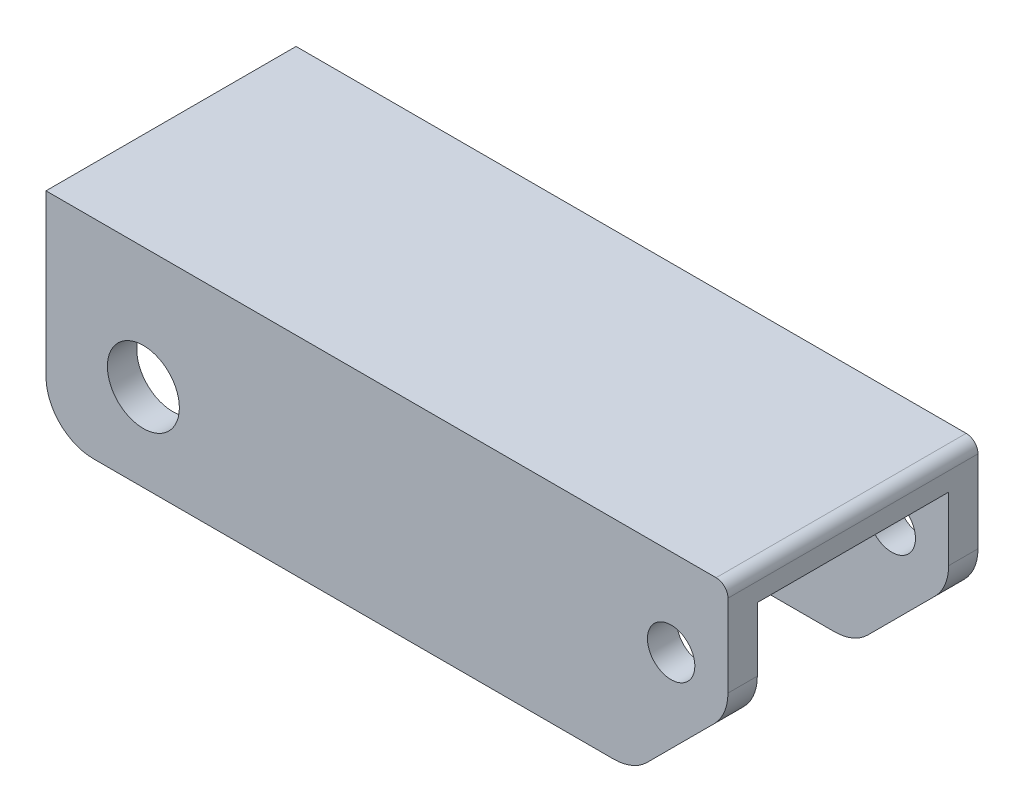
ISO-10303-21;
HEADER;
FILE_DESCRIPTION(('STEP AP214'),'2;1');
FILE_NAME('part.step','',(''),(''),'','','');
FILE_SCHEMA(('AUTOMOTIVE_DESIGN { 1 0 10303 214 1 1 1 1 }'));
ENDSEC;
DATA;
#1=APPLICATION_CONTEXT('core data for automotive mechanical design processes');
#2=APPLICATION_PROTOCOL_DEFINITION('international standard','automotive_design',2000,#1);
#3=PRODUCT_CONTEXT('',#1,'mechanical');
#4=PRODUCT('Part','Part','',(#3));
#5=PRODUCT_RELATED_PRODUCT_CATEGORY('part','',(#4));
#6=PRODUCT_DEFINITION_FORMATION('','',#4);
#7=PRODUCT_DEFINITION_CONTEXT('part definition',#1,'design');
#8=PRODUCT_DEFINITION('design','',#6,#7);
#9=PRODUCT_DEFINITION_SHAPE('','',#8);
#10=(LENGTH_UNIT() NAMED_UNIT(*) SI_UNIT(.MILLI.,.METRE.));
#11=(NAMED_UNIT(*) PLANE_ANGLE_UNIT() SI_UNIT($,.RADIAN.));
#12=(NAMED_UNIT(*) SI_UNIT($,.STERADIAN.) SOLID_ANGLE_UNIT());
#13=UNCERTAINTY_MEASURE_WITH_UNIT(LENGTH_MEASURE(1.E-05),#10,'distance_accuracy_value','');
#14=(GEOMETRIC_REPRESENTATION_CONTEXT(3) GLOBAL_UNCERTAINTY_ASSIGNED_CONTEXT((#13)) GLOBAL_UNIT_ASSIGNED_CONTEXT((#10,
#11,#12)) REPRESENTATION_CONTEXT('',''));
#15=CARTESIAN_POINT('',(0.,0.,0.));
#16=DIRECTION('',(0.,0.,1.));
#17=DIRECTION('',(1.,0.,0.));
#18=AXIS2_PLACEMENT_3D('',#15,#16,#17);
#19=CARTESIAN_POINT('',(45.72,0.,-64.5706867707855));
#20=DIRECTION('',(0.,-1.,0.));
#21=DIRECTION('',(1.,0.,0.));
#22=AXIS2_PLACEMENT_3D('',#19,#20,#21);
#23=PLANE('',#22);
#24=DIRECTION('',(1.,0.,0.));
#25=VECTOR('',#24,1.);
#26=CARTESIAN_POINT('',(45.72,0.,2.032));
#27=LINE('',#26,#25);
#28=CARTESIAN_POINT('',(3.175,0.,2.032));
#29=VERTEX_POINT('',#28);
#30=CARTESIAN_POINT('',(38.0548719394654,0.,2.032));
#31=VERTEX_POINT('',#30);
#32=EDGE_CURVE('E252',#29,#31,#27,.T.);
#33=ORIENTED_EDGE('',*,*,#32,.F.);
#34=DIRECTION('',(0.,0.,1.));
#35=VECTOR('',#34,1.);
#36=CARTESIAN_POINT('',(3.175,0.,0.0635000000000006));
#37=LINE('',#36,#35);
#38=CARTESIAN_POINT('',(3.175,0.,0.063500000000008));
#39=VERTEX_POINT('',#38);
#40=EDGE_CURVE('E228',#29,#39,#37,.F.);
#41=ORIENTED_EDGE('',*,*,#40,.T.);
#42=DIRECTION('',(-1.,0.,0.));
#43=VECTOR('',#42,1.);
#44=CARTESIAN_POINT('',(45.72,0.,0.063500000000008));
#45=LINE('',#44,#43);
#46=CARTESIAN_POINT('',(38.0548719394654,0.,0.0635000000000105));
#47=VERTEX_POINT('',#46);
#48=EDGE_CURVE('E267',#47,#39,#45,.T.);
#49=ORIENTED_EDGE('',*,*,#48,.F.);
#50=DIRECTION('',(0.,0.,-1.));
#51=VECTOR('',#50,1.);
#52=CARTESIAN_POINT('',(38.0548719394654,0.,-64.5706867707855));
#53=LINE('',#52,#51);
#54=EDGE_CURVE('E198',#47,#31,#53,.F.);
#55=ORIENTED_EDGE('',*,*,#54,.T.);
#56=EDGE_LOOP('',(#33,#41,#49,#55));
#57=FACE_BOUND('',#56,.T.);
#58=ADVANCED_FACE('F34',(#57),#23,.T.);
#59=CARTESIAN_POINT('',(6.52779999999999,5.842,-64.5706867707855));
#60=DIRECTION('',(0.,0.,1.));
#61=DIRECTION('',(1.,0.,0.));
#62=AXIS2_PLACEMENT_3D('',#59,#60,#61);
#63=CYLINDRICAL_SURFACE('',#62,2.413);
#64=CARTESIAN_POINT('',(6.52779999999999,5.842,0.063500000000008));
#65=DIRECTION('',(0.,0.,1.));
#66=DIRECTION('',(0.,-1.,0.));
#67=AXIS2_PLACEMENT_3D('',#64,#65,#66);
#68=CIRCLE('',#67,2.413);
#69=CARTESIAN_POINT('',(6.52779999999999,3.429,0.0635000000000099));
#70=VERTEX_POINT('',#69);
#71=EDGE_CURVE('E264',#70,#70,#68,.F.);
#72=ORIENTED_EDGE('',*,*,#71,.T.);
#73=EDGE_LOOP('',(#72));
#74=FACE_BOUND('',#73,.T.);
#75=CARTESIAN_POINT('',(6.52779999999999,5.842,2.032));
#76=DIRECTION('',(0.,0.,1.));
#77=DIRECTION('',(1.,0.,0.));
#78=AXIS2_PLACEMENT_3D('',#75,#76,#77);
#79=CIRCLE('',#78,2.413);
#80=CARTESIAN_POINT('',(8.94079999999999,5.842,2.032));
#81=VERTEX_POINT('',#80);
#82=EDGE_CURVE('E258',#81,#81,#79,.T.);
#83=ORIENTED_EDGE('',*,*,#82,.T.);
#84=EDGE_LOOP('',(#83));
#85=FACE_BOUND('',#84,.T.);
#86=ADVANCED_FACE('F376',(#74,#85),#63,.F.);
#87=CARTESIAN_POINT('',(48.4558606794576,9.08586067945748,86.3129301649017));
#88=DIRECTION('',(0.707106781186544,-0.707106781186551,0.));
#89=DIRECTION('',(0.707106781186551,0.707106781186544,0.));
#90=AXIS2_PLACEMENT_3D('',#87,#88,#89);
#91=PLANE('',#90);
#92=DIRECTION('',(-0.707106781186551,-0.707106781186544,0.));
#93=VECTOR('',#92,1.);
#94=CARTESIAN_POINT('',(48.4558606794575,9.08586067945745,0.0634999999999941));
#95=LINE('',#94,#93);
#96=CARTESIAN_POINT('',(44.7900640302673,5.42006403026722,0.0634999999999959));
#97=VERTEX_POINT('',#96);
#98=CARTESIAN_POINT('',(40.2999359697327,0.929935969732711,0.0635000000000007));
#99=VERTEX_POINT('',#98);
#100=EDGE_CURVE('E272',#97,#99,#95,.T.);
#101=ORIENTED_EDGE('',*,*,#100,.F.);
#102=DIRECTION('',(0.,0.,-1.));
#103=VECTOR('',#102,1.);
#104=CARTESIAN_POINT('',(44.7900640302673,5.42006403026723,86.3129301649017));
#105=LINE('',#104,#103);
#106=CARTESIAN_POINT('',(44.7900640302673,5.42006403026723,2.032));
#107=VERTEX_POINT('',#106);
#108=EDGE_CURVE('E186',#97,#107,#105,.F.);
#109=ORIENTED_EDGE('',*,*,#108,.T.);
#110=DIRECTION('',(0.707106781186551,0.707106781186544,0.));
#111=VECTOR('',#110,1.);
#112=CARTESIAN_POINT('',(49.53,10.1599999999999,2.032));
#113=LINE('',#112,#111);
#114=CARTESIAN_POINT('',(40.2999359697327,0.929935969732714,2.032));
#115=VERTEX_POINT('',#114);
#116=EDGE_CURVE('E178',#115,#107,#113,.T.);
#117=ORIENTED_EDGE('',*,*,#116,.F.);
#118=DIRECTION('',(0.,0.,-1.));
#119=VECTOR('',#118,1.);
#120=CARTESIAN_POINT('',(40.2999359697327,0.929935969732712,86.3129301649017));
#121=LINE('',#120,#119);
#122=EDGE_CURVE('E191',#115,#99,#121,.T.);
#123=ORIENTED_EDGE('',*,*,#122,.T.);
#124=EDGE_LOOP('',(#101,#109,#117,#123));
#125=FACE_BOUND('',#124,.T.);
#126=ADVANCED_FACE('F361',(#125),#91,.T.);
#127=CARTESIAN_POINT('',(38.0548719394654,3.17500000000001,86.3129301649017));
#128=DIRECTION('',(0.,0.,-1.));
#129=DIRECTION('',(-1.,0.,0.));
#130=AXIS2_PLACEMENT_3D('',#127,#128,#129);
#131=CYLINDRICAL_SURFACE('',#130,3.175);
#132=CARTESIAN_POINT('',(38.0548719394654,3.17500000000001,0.063500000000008));
#133=DIRECTION('',(0.,0.,1.));
#134=DIRECTION('',(0.,-1.,0.));
#135=AXIS2_PLACEMENT_3D('',#132,#133,#134);
#136=CIRCLE('',#135,3.175);
#137=EDGE_CURVE('E270',#99,#47,#136,.F.);
#138=ORIENTED_EDGE('',*,*,#137,.F.);
#139=ORIENTED_EDGE('',*,*,#122,.F.);
#140=CARTESIAN_POINT('',(38.0548719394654,3.17500000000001,2.03200000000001));
#141=DIRECTION('',(0.,0.,1.));
#142=DIRECTION('',(1.,0.,0.));
#143=AXIS2_PLACEMENT_3D('',#140,#141,#142);
#144=CIRCLE('',#143,3.175);
#145=EDGE_CURVE('E204',#31,#115,#144,.T.);
#146=ORIENTED_EDGE('',*,*,#145,.F.);
#147=ORIENTED_EDGE('',*,*,#54,.F.);
#148=EDGE_LOOP('',(#138,#139,#146,#147));
#149=FACE_BOUND('',#148,.T.);
#150=ADVANCED_FACE('F357',(#149),#131,.T.);
#151=CARTESIAN_POINT('',(42.545,7.66512806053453,-64.5706867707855));
#152=DIRECTION('',(0.,0.,-1.));
#153=DIRECTION('',(-1.,0.,0.));
#154=AXIS2_PLACEMENT_3D('',#151,#152,#153);
#155=CYLINDRICAL_SURFACE('',#154,3.175);
#156=CARTESIAN_POINT('',(42.545,7.66512806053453,0.0634999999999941));
#157=DIRECTION('',(0.,0.,1.));
#158=DIRECTION('',(0.,-1.,0.));
#159=AXIS2_PLACEMENT_3D('',#156,#157,#158);
#160=CIRCLE('',#159,3.175);
#161=CARTESIAN_POINT('',(45.72,7.66512806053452,0.0634999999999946));
#162=VERTEX_POINT('',#161);
#163=EDGE_CURVE('E212',#162,#97,#160,.F.);
#164=ORIENTED_EDGE('',*,*,#163,.F.);
#165=DIRECTION('',(0.,0.,-1.));
#166=VECTOR('',#165,1.);
#167=CARTESIAN_POINT('',(45.72,7.66512806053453,-64.5706867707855));
#168=LINE('',#167,#166);
#169=CARTESIAN_POINT('',(45.72,7.66512806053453,2.032));
#170=VERTEX_POINT('',#169);
#171=EDGE_CURVE('E207',#170,#162,#168,.T.);
#172=ORIENTED_EDGE('',*,*,#171,.F.);
#173=CARTESIAN_POINT('',(42.545,7.66512806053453,2.03200000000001));
#174=DIRECTION('',(0.,0.,1.));
#175=DIRECTION('',(1.,0.,0.));
#176=AXIS2_PLACEMENT_3D('',#173,#174,#175);
#177=CIRCLE('',#176,3.175);
#178=EDGE_CURVE('E202',#107,#170,#177,.T.);
#179=ORIENTED_EDGE('',*,*,#178,.F.);
#180=ORIENTED_EDGE('',*,*,#108,.F.);
#181=EDGE_LOOP('',(#164,#172,#179,#180));
#182=FACE_BOUND('',#181,.T.);
#183=ADVANCED_FACE('F365',(#182),#155,.T.);
#184=DIRECTION('',(1.,0.,0.));
#185=VECTOR('',#184,1.);
#186=CARTESIAN_POINT('',(45.72,0.,-12.7635));
#187=LINE('',#186,#185);
#188=CARTESIAN_POINT('',(3.175,0.,-12.7635));
#189=VERTEX_POINT('',#188);
#190=CARTESIAN_POINT('',(38.0548719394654,0.,-12.7635));
#191=VERTEX_POINT('',#190);
#192=EDGE_CURVE('E277',#189,#191,#187,.T.);
#193=ORIENTED_EDGE('',*,*,#192,.F.);
#194=DIRECTION('',(0.,0.,1.));
#195=VECTOR('',#194,1.);
#196=CARTESIAN_POINT('',(3.175,0.,-14.732));
#197=LINE('',#196,#195);
#198=CARTESIAN_POINT('',(3.175,0.,-14.732));
#199=VERTEX_POINT('',#198);
#200=EDGE_CURVE('E234',#189,#199,#197,.F.);
#201=ORIENTED_EDGE('',*,*,#200,.T.);
#202=DIRECTION('',(-1.,0.,0.));
#203=VECTOR('',#202,1.);
#204=CARTESIAN_POINT('',(45.72,0.,-14.732));
#205=LINE('',#204,#203);
#206=CARTESIAN_POINT('',(38.0548719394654,0.,-14.732));
#207=VERTEX_POINT('',#206);
#208=EDGE_CURVE('E180',#207,#199,#205,.T.);
#209=ORIENTED_EDGE('',*,*,#208,.F.);
#210=EDGE_CURVE('E199',#207,#191,#53,.F.);
#211=ORIENTED_EDGE('',*,*,#210,.T.);
#212=EDGE_LOOP('',(#193,#201,#209,#211));
#213=FACE_BOUND('',#212,.T.);
#214=ADVANCED_FACE('F326',(#213),#23,.T.);
#215=CARTESIAN_POINT('',(45.72,13.97,-64.5706867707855));
#216=DIRECTION('',(1.,0.,0.));
#217=DIRECTION('',(0.,0.,-1.));
#218=AXIS2_PLACEMENT_3D('',#215,#216,#217);
#219=PLANE('',#218);
#220=DIRECTION('',(0.,-1.,0.));
#221=VECTOR('',#220,1.);
#222=CARTESIAN_POINT('',(45.72,13.97,-14.732));
#223=LINE('',#222,#221);
#224=CARTESIAN_POINT('',(45.72,13.17625,-14.732));
#225=VERTEX_POINT('',#224);
#226=CARTESIAN_POINT('',(45.72,7.66512806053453,-14.732));
#227=VERTEX_POINT('',#226);
#228=EDGE_CURVE('E175',#225,#227,#223,.T.);
#229=ORIENTED_EDGE('',*,*,#228,.F.);
#230=DIRECTION('',(0.,0.,1.));
#231=VECTOR('',#230,1.);
#232=CARTESIAN_POINT('',(45.72,13.17625,-64.5706867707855));
#233=LINE('',#232,#231);
#234=CARTESIAN_POINT('',(45.72,13.17625,2.032));
#235=VERTEX_POINT('',#234);
#236=EDGE_CURVE('E237',#225,#235,#233,.T.);
#237=ORIENTED_EDGE('',*,*,#236,.T.);
#238=DIRECTION('',(0.,1.,0.));
#239=VECTOR('',#238,1.);
#240=CARTESIAN_POINT('',(45.72,13.97,2.032));
#241=LINE('',#240,#239);
#242=EDGE_CURVE('E245',#170,#235,#241,.T.);
#243=ORIENTED_EDGE('',*,*,#242,.F.);
#244=ORIENTED_EDGE('',*,*,#171,.T.);
#245=DIRECTION('',(0.,-1.,0.));
#246=VECTOR('',#245,1.);
#247=CARTESIAN_POINT('',(45.72,-2.54,0.0635000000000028));
#248=LINE('',#247,#246);
#249=CARTESIAN_POINT('',(45.72,11.938,0.0634999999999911));
#250=VERTEX_POINT('',#249);
#251=EDGE_CURVE('E293',#250,#162,#248,.T.);
#252=ORIENTED_EDGE('',*,*,#251,.F.);
#253=DIRECTION('',(0.,0.,1.));
#254=VECTOR('',#253,1.);
#255=CARTESIAN_POINT('',(45.72,11.938,0.0634999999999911));
#256=LINE('',#255,#254);
#257=CARTESIAN_POINT('',(45.72,11.938,-12.7635));
#258=VERTEX_POINT('',#257);
#259=EDGE_CURVE('E286',#258,#250,#256,.T.);
#260=ORIENTED_EDGE('',*,*,#259,.F.);
#261=DIRECTION('',(0.,1.,0.));
#262=VECTOR('',#261,1.);
#263=CARTESIAN_POINT('',(45.72,-2.54,-12.7635));
#264=LINE('',#263,#262);
#265=CARTESIAN_POINT('',(45.72,7.66512806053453,-12.7635));
#266=VERTEX_POINT('',#265);
#267=EDGE_CURVE('E290',#266,#258,#264,.T.);
#268=ORIENTED_EDGE('',*,*,#267,.F.);
#269=EDGE_CURVE('E206',#266,#227,#168,.T.);
#270=ORIENTED_EDGE('',*,*,#269,.T.);
#271=EDGE_LOOP('',(#229,#237,#243,#244,#252,#260,#268,#270));
#272=FACE_BOUND('',#271,.T.);
#273=ADVANCED_FACE('F244',(#272),#219,.T.);
#274=CARTESIAN_POINT('',(-9.10147894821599,109.867298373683,-14.732));
#275=DIRECTION('',(0.,0.,1.));
#276=DIRECTION('',(1.,0.,0.));
#277=AXIS2_PLACEMENT_3D('',#274,#275,#276);
#278=PLANE('',#277);
#279=CARTESIAN_POINT('',(41.91,8.12800000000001,-14.732));
#280=DIRECTION('',(0.,0.,-1.));
#281=DIRECTION('',(-1.,0.,0.));
#282=AXIS2_PLACEMENT_3D('',#279,#280,#281);
#283=CIRCLE('',#282,1.5875);
#284=CARTESIAN_POINT('',(40.3225,8.12800000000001,-14.732));
#285=VERTEX_POINT('',#284);
#286=EDGE_CURVE('E163',#285,#285,#283,.T.);
#287=ORIENTED_EDGE('',*,*,#286,.F.);
#288=EDGE_LOOP('',(#287));
#289=FACE_BOUND('',#288,.T.);
#290=CARTESIAN_POINT('',(6.52779999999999,5.842,-14.732));
#291=DIRECTION('',(0.,0.,1.));
#292=DIRECTION('',(1.,0.,0.));
#293=AXIS2_PLACEMENT_3D('',#290,#291,#292);
#294=CIRCLE('',#293,2.413);
#295=CARTESIAN_POINT('',(8.94079999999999,5.842,-14.732));
#296=VERTEX_POINT('',#295);
#297=EDGE_CURVE('E174',#296,#296,#294,.F.);
#298=ORIENTED_EDGE('',*,*,#297,.F.);
#299=EDGE_LOOP('',(#298));
#300=FACE_BOUND('',#299,.T.);
#301=DIRECTION('',(1.,0.,0.));
#302=VECTOR('',#301,1.);
#303=CARTESIAN_POINT('',(45.72,13.97,-14.732));
#304=LINE('',#303,#302);
#305=CARTESIAN_POINT('',(0.,13.97,-14.732));
#306=VERTEX_POINT('',#305);
#307=CARTESIAN_POINT('',(44.92625,13.97,-14.732));
#308=VERTEX_POINT('',#307);
#309=EDGE_CURVE('E168',#306,#308,#304,.T.);
#310=ORIENTED_EDGE('',*,*,#309,.T.);
#311=CARTESIAN_POINT('',(44.92625,13.17625,-14.732));
#312=DIRECTION('',(0.,0.,1.));
#313=DIRECTION('',(1.,0.,0.));
#314=AXIS2_PLACEMENT_3D('',#311,#312,#313);
#315=CIRCLE('',#314,0.79375);
#316=EDGE_CURVE('E11',#308,#225,#315,.F.);
#317=ORIENTED_EDGE('',*,*,#316,.T.);
#318=ORIENTED_EDGE('',*,*,#228,.T.);
#319=CARTESIAN_POINT('',(42.545,7.66512806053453,-14.732));
#320=DIRECTION('',(0.,0.,1.));
#321=DIRECTION('',(1.,0.,0.));
#322=AXIS2_PLACEMENT_3D('',#319,#320,#321);
#323=CIRCLE('',#322,3.175);
#324=CARTESIAN_POINT('',(44.7900640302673,5.42006403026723,-14.732));
#325=VERTEX_POINT('',#324);
#326=EDGE_CURVE('E194',#227,#325,#323,.F.);
#327=ORIENTED_EDGE('',*,*,#326,.T.);
#328=DIRECTION('',(0.707106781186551,0.707106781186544,0.));
#329=VECTOR('',#328,1.);
#330=CARTESIAN_POINT('',(70.0679097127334,30.6979097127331,-14.732));
#331=LINE('',#330,#329);
#332=CARTESIAN_POINT('',(40.2999359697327,0.929935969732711,-14.732));
#333=VERTEX_POINT('',#332);
#334=EDGE_CURVE('E261',#333,#325,#331,.T.);
#335=ORIENTED_EDGE('',*,*,#334,.F.);
#336=CARTESIAN_POINT('',(38.0548719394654,3.17500000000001,-14.732));
#337=DIRECTION('',(0.,0.,1.));
#338=DIRECTION('',(1.,0.,0.));
#339=AXIS2_PLACEMENT_3D('',#336,#337,#338);
#340=CIRCLE('',#339,3.175);
#341=EDGE_CURVE('E196',#333,#207,#340,.F.);
#342=ORIENTED_EDGE('',*,*,#341,.T.);
#343=ORIENTED_EDGE('',*,*,#208,.T.);
#344=CARTESIAN_POINT('',(3.175,3.175,-14.732));
#345=DIRECTION('',(0.,0.,1.));
#346=DIRECTION('',(1.,0.,0.));
#347=AXIS2_PLACEMENT_3D('',#344,#345,#346);
#348=CIRCLE('',#347,3.175);
#349=CARTESIAN_POINT('',(0.,3.175,-14.732));
#350=VERTEX_POINT('',#349);
#351=EDGE_CURVE('E172',#199,#350,#348,.F.);
#352=ORIENTED_EDGE('',*,*,#351,.T.);
#353=DIRECTION('',(0.,-1.,0.));
#354=VECTOR('',#353,1.);
#355=CARTESIAN_POINT('',(0.,15.3248363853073,-14.732));
#356=LINE('',#355,#354);
#357=EDGE_CURVE('E158',#306,#350,#356,.T.);
#358=ORIENTED_EDGE('',*,*,#357,.F.);
#359=EDGE_LOOP('',(#310,#317,#318,#327,#335,#342,#343,#352,#358));
#360=FACE_BOUND('',#359,.T.);
#361=ADVANCED_FACE('F167',(#289,#300,#360),#278,.F.);
#362=CARTESIAN_POINT('',(45.72,13.97,2.032));
#363=DIRECTION('',(0.,0.,1.));
#364=DIRECTION('',(1.,0.,0.));
#365=AXIS2_PLACEMENT_3D('',#362,#363,#364);
#366=PLANE('',#365);
#367=ORIENTED_EDGE('',*,*,#242,.T.);
#368=CARTESIAN_POINT('',(44.92625,13.17625,2.03200000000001));
#369=DIRECTION('',(0.,0.,1.));
#370=DIRECTION('',(1.,0.,0.));
#371=AXIS2_PLACEMENT_3D('',#368,#369,#370);
#372=CIRCLE('',#371,0.79375);
#373=CARTESIAN_POINT('',(44.92625,13.97,2.032));
#374=VERTEX_POINT('',#373);
#375=EDGE_CURVE('E56',#235,#374,#372,.T.);
#376=ORIENTED_EDGE('',*,*,#375,.T.);
#377=DIRECTION('',(-1.,0.,0.));
#378=VECTOR('',#377,1.);
#379=CARTESIAN_POINT('',(45.72,13.97,2.032));
#380=LINE('',#379,#378);
#381=CARTESIAN_POINT('',(0.,13.97,2.032));
#382=VERTEX_POINT('',#381);
#383=EDGE_CURVE('E254',#374,#382,#380,.T.);
#384=ORIENTED_EDGE('',*,*,#383,.T.);
#385=DIRECTION('',(0.,-1.,0.));
#386=VECTOR('',#385,1.);
#387=CARTESIAN_POINT('',(0.,15.3248363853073,2.032));
#388=LINE('',#387,#386);
#389=CARTESIAN_POINT('',(0.,3.175,2.032));
#390=VERTEX_POINT('',#389);
#391=EDGE_CURVE('E162',#382,#390,#388,.T.);
#392=ORIENTED_EDGE('',*,*,#391,.T.);
#393=CARTESIAN_POINT('',(3.175,3.175,2.032));
#394=DIRECTION('',(0.,0.,1.));
#395=DIRECTION('',(1.,0.,0.));
#396=AXIS2_PLACEMENT_3D('',#393,#394,#395);
#397=CIRCLE('',#396,3.175);
#398=EDGE_CURVE('E226',#390,#29,#397,.T.);
#399=ORIENTED_EDGE('',*,*,#398,.T.);
#400=ORIENTED_EDGE('',*,*,#32,.T.);
#401=ORIENTED_EDGE('',*,*,#145,.T.);
#402=ORIENTED_EDGE('',*,*,#116,.T.);
#403=ORIENTED_EDGE('',*,*,#178,.T.);
#404=EDGE_LOOP('',(#367,#376,#384,#392,#399,#400,#401,#402,#403));
#405=FACE_BOUND('',#404,.T.);
#406=CARTESIAN_POINT('',(41.91,8.12800000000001,2.032));
#407=DIRECTION('',(0.,0.,-1.));
#408=DIRECTION('',(-1.,0.,0.));
#409=AXIS2_PLACEMENT_3D('',#406,#407,#408);
#410=CIRCLE('',#409,1.5875);
#411=CARTESIAN_POINT('',(40.3225,8.12800000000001,2.032));
#412=VERTEX_POINT('',#411);
#413=EDGE_CURVE('E219',#412,#412,#410,.T.);
#414=ORIENTED_EDGE('',*,*,#413,.T.);
#415=EDGE_LOOP('',(#414));
#416=FACE_BOUND('',#415,.T.);
#417=ORIENTED_EDGE('',*,*,#82,.F.);
#418=EDGE_LOOP('',(#417));
#419=FACE_BOUND('',#418,.T.);
#420=ADVANCED_FACE('F249',(#405,#416,#419),#366,.T.);
#421=CARTESIAN_POINT('',(45.72,13.97,-64.5706867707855));
#422=DIRECTION('',(0.,1.,0.));
#423=DIRECTION('',(-1.,0.,0.));
#424=AXIS2_PLACEMENT_3D('',#421,#422,#423);
#425=PLANE('',#424);
#426=ORIENTED_EDGE('',*,*,#383,.F.);
#427=DIRECTION('',(0.,0.,1.));
#428=VECTOR('',#427,1.);
#429=CARTESIAN_POINT('',(44.92625,13.97,-64.5706867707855));
#430=LINE('',#429,#428);
#431=EDGE_CURVE('E42',#374,#308,#430,.F.);
#432=ORIENTED_EDGE('',*,*,#431,.T.);
#433=ORIENTED_EDGE('',*,*,#309,.F.);
#434=DIRECTION('',(0.,0.,-1.));
#435=VECTOR('',#434,1.);
#436=CARTESIAN_POINT('',(0.,13.97,-64.5706867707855));
#437=LINE('',#436,#435);
#438=EDGE_CURVE('E153',#382,#306,#437,.T.);
#439=ORIENTED_EDGE('',*,*,#438,.F.);
#440=EDGE_LOOP('',(#426,#432,#433,#439));
#441=FACE_BOUND('',#440,.T.);
#442=ADVANCED_FACE('F36',(#441),#425,.T.);
#443=CARTESIAN_POINT('',(6.52779999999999,5.842,-12.7635));
#444=DIRECTION('',(0.,0.,-1.));
#445=DIRECTION('',(0.,1.,0.));
#446=AXIS2_PLACEMENT_3D('',#443,#444,#445);
#447=CIRCLE('',#446,2.413);
#448=CARTESIAN_POINT('',(6.52779999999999,8.25499999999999,-12.7635));
#449=VERTEX_POINT('',#448);
#450=EDGE_CURVE('E274',#449,#449,#447,.F.);
#451=ORIENTED_EDGE('',*,*,#450,.T.);
#452=EDGE_LOOP('',(#451));
#453=FACE_BOUND('',#452,.T.);
#454=ORIENTED_EDGE('',*,*,#297,.T.);
#455=EDGE_LOOP('',(#454));
#456=FACE_BOUND('',#455,.T.);
#457=ADVANCED_FACE('F382',(#453,#456),#63,.F.);
#458=DIRECTION('',(0.707106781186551,0.707106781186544,0.));
#459=VECTOR('',#458,1.);
#460=CARTESIAN_POINT('',(48.4558606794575,9.08586067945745,-12.7635));
#461=LINE('',#460,#459);
#462=CARTESIAN_POINT('',(40.2999359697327,0.929935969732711,-12.7635));
#463=VERTEX_POINT('',#462);
#464=CARTESIAN_POINT('',(44.7900640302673,5.42006403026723,-12.7635));
#465=VERTEX_POINT('',#464);
#466=EDGE_CURVE('E281',#463,#465,#461,.T.);
#467=ORIENTED_EDGE('',*,*,#466,.F.);
#468=EDGE_CURVE('E190',#463,#333,#121,.T.);
#469=ORIENTED_EDGE('',*,*,#468,.T.);
#470=ORIENTED_EDGE('',*,*,#334,.T.);
#471=EDGE_CURVE('E187',#325,#465,#105,.F.);
#472=ORIENTED_EDGE('',*,*,#471,.T.);
#473=EDGE_LOOP('',(#467,#469,#470,#472));
#474=FACE_BOUND('',#473,.T.);
#475=ADVANCED_FACE('F318',(#474),#91,.T.);
#476=CARTESIAN_POINT('',(38.0548719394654,3.17500000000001,-12.7635));
#477=DIRECTION('',(0.,0.,-1.));
#478=DIRECTION('',(0.,1.,0.));
#479=AXIS2_PLACEMENT_3D('',#476,#477,#478);
#480=CIRCLE('',#479,3.175);
#481=EDGE_CURVE('E279',#191,#463,#480,.F.);
#482=ORIENTED_EDGE('',*,*,#481,.F.);
#483=ORIENTED_EDGE('',*,*,#210,.F.);
#484=ORIENTED_EDGE('',*,*,#341,.F.);
#485=ORIENTED_EDGE('',*,*,#468,.F.);
#486=EDGE_LOOP('',(#482,#483,#484,#485));
#487=FACE_BOUND('',#486,.T.);
#488=ADVANCED_FACE('F329',(#487),#131,.T.);
#489=CARTESIAN_POINT('',(42.545,7.66512806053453,-12.7635));
#490=DIRECTION('',(0.,0.,-1.));
#491=DIRECTION('',(0.,1.,0.));
#492=AXIS2_PLACEMENT_3D('',#489,#490,#491);
#493=CIRCLE('',#492,3.175);
#494=EDGE_CURVE('E210',#465,#266,#493,.F.);
#495=ORIENTED_EDGE('',*,*,#494,.F.);
#496=ORIENTED_EDGE('',*,*,#471,.F.);
#497=ORIENTED_EDGE('',*,*,#326,.F.);
#498=ORIENTED_EDGE('',*,*,#269,.F.);
#499=EDGE_LOOP('',(#495,#496,#497,#498));
#500=FACE_BOUND('',#499,.T.);
#501=ADVANCED_FACE('F315',(#500),#155,.T.);
#502=CARTESIAN_POINT('',(0.,-2.54,0.0635000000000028));
#503=DIRECTION('',(0.,0.,1.));
#504=DIRECTION('',(0.,-1.,0.));
#505=AXIS2_PLACEMENT_3D('',#502,#503,#504);
#506=PLANE('',#505);
#507=CARTESIAN_POINT('',(41.91,8.12800000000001,0.0634999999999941));
#508=DIRECTION('',(0.,0.,1.));
#509=DIRECTION('',(0.,-1.,0.));
#510=AXIS2_PLACEMENT_3D('',#507,#508,#509);
#511=CIRCLE('',#510,1.5875);
#512=CARTESIAN_POINT('',(40.3225,8.12800000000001,0.0634999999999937));
#513=VERTEX_POINT('',#512);
#514=EDGE_CURVE('E218',#513,#513,#511,.T.);
#515=ORIENTED_EDGE('',*,*,#514,.T.);
#516=EDGE_LOOP('',(#515));
#517=FACE_BOUND('',#516,.T.);
#518=ORIENTED_EDGE('',*,*,#48,.T.);
#519=CARTESIAN_POINT('',(3.175,3.175,0.063499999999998));
#520=DIRECTION('',(0.,0.,1.));
#521=DIRECTION('',(0.,-1.,0.));
#522=AXIS2_PLACEMENT_3D('',#519,#520,#521);
#523=CIRCLE('',#522,3.175);
#524=CARTESIAN_POINT('',(0.,3.175,0.0634999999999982));
#525=VERTEX_POINT('',#524);
#526=EDGE_CURVE('E230',#39,#525,#523,.F.);
#527=ORIENTED_EDGE('',*,*,#526,.T.);
#528=DIRECTION('',(0.,1.,0.));
#529=VECTOR('',#528,1.);
#530=CARTESIAN_POINT('',(0.,-2.54,0.0635000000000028));
#531=LINE('',#530,#529);
#532=CARTESIAN_POINT('',(0.,11.938,0.0634999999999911));
#533=VERTEX_POINT('',#532);
#534=EDGE_CURVE('E164',#525,#533,#531,.T.);
#535=ORIENTED_EDGE('',*,*,#534,.T.);
#536=DIRECTION('',(1.,0.,0.));
#537=VECTOR('',#536,1.);
#538=CARTESIAN_POINT('',(0.,11.938,0.0634999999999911));
#539=LINE('',#538,#537);
#540=EDGE_CURVE('E283',#533,#250,#539,.T.);
#541=ORIENTED_EDGE('',*,*,#540,.T.);
#542=ORIENTED_EDGE('',*,*,#251,.T.);
#543=ORIENTED_EDGE('',*,*,#163,.T.);
#544=ORIENTED_EDGE('',*,*,#100,.T.);
#545=ORIENTED_EDGE('',*,*,#137,.T.);
#546=EDGE_LOOP('',(#518,#527,#535,#541,#542,#543,#544,#545));
#547=FACE_BOUND('',#546,.T.);
#548=ORIENTED_EDGE('',*,*,#71,.F.);
#549=EDGE_LOOP('',(#548));
#550=FACE_BOUND('',#549,.T.);
#551=ADVANCED_FACE('F351',(#517,#547,#550),#506,.F.);
#552=CARTESIAN_POINT('',(0.,-2.54,-12.7635));
#553=DIRECTION('',(0.,0.,-1.));
#554=DIRECTION('',(0.,1.,0.));
#555=AXIS2_PLACEMENT_3D('',#552,#553,#554);
#556=PLANE('',#555);
#557=CARTESIAN_POINT('',(41.91,8.12800000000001,-12.7635));
#558=DIRECTION('',(0.,0.,-1.));
#559=DIRECTION('',(0.,1.,0.));
#560=AXIS2_PLACEMENT_3D('',#557,#558,#559);
#561=CIRCLE('',#560,1.5875);
#562=CARTESIAN_POINT('',(40.3225,8.12800000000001,-12.7635));
#563=VERTEX_POINT('',#562);
#564=EDGE_CURVE('E215',#563,#563,#561,.T.);
#565=ORIENTED_EDGE('',*,*,#564,.T.);
#566=EDGE_LOOP('',(#565));
#567=FACE_BOUND('',#566,.T.);
#568=DIRECTION('',(0.,-1.,0.));
#569=VECTOR('',#568,1.);
#570=CARTESIAN_POINT('',(0.,-2.54,-12.7635));
#571=LINE('',#570,#569);
#572=CARTESIAN_POINT('',(0.,11.938,-12.7635));
#573=VERTEX_POINT('',#572);
#574=CARTESIAN_POINT('',(0.,3.175,-12.7635));
#575=VERTEX_POINT('',#574);
#576=EDGE_CURVE('E302',#573,#575,#571,.T.);
#577=ORIENTED_EDGE('',*,*,#576,.T.);
#578=CARTESIAN_POINT('',(3.175,3.175,-12.7635));
#579=DIRECTION('',(0.,0.,-1.));
#580=DIRECTION('',(0.,1.,0.));
#581=AXIS2_PLACEMENT_3D('',#578,#579,#580);
#582=CIRCLE('',#581,3.175);
#583=EDGE_CURVE('E232',#575,#189,#582,.F.);
#584=ORIENTED_EDGE('',*,*,#583,.T.);
#585=ORIENTED_EDGE('',*,*,#192,.T.);
#586=ORIENTED_EDGE('',*,*,#481,.T.);
#587=ORIENTED_EDGE('',*,*,#466,.T.);
#588=ORIENTED_EDGE('',*,*,#494,.T.);
#589=ORIENTED_EDGE('',*,*,#267,.T.);
#590=DIRECTION('',(1.,0.,0.));
#591=VECTOR('',#590,1.);
#592=CARTESIAN_POINT('',(0.,11.938,-12.7635));
#593=LINE('',#592,#591);
#594=EDGE_CURVE('E284',#573,#258,#593,.T.);
#595=ORIENTED_EDGE('',*,*,#594,.F.);
#596=EDGE_LOOP('',(#577,#584,#585,#586,#587,#588,#589,#595));
#597=FACE_BOUND('',#596,.T.);
#598=ORIENTED_EDGE('',*,*,#450,.F.);
#599=EDGE_LOOP('',(#598));
#600=FACE_BOUND('',#599,.T.);
#601=ADVANCED_FACE('F331',(#567,#597,#600),#556,.F.);
#602=CARTESIAN_POINT('',(0.,11.938,0.0634999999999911));
#603=DIRECTION('',(0.,1.,0.));
#604=DIRECTION('',(0.,0.,1.));
#605=AXIS2_PLACEMENT_3D('',#602,#603,#604);
#606=PLANE('',#605);
#607=ORIENTED_EDGE('',*,*,#540,.F.);
#608=DIRECTION('',(0.,0.,-1.));
#609=VECTOR('',#608,1.);
#610=CARTESIAN_POINT('',(0.,11.938,0.0634999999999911));
#611=LINE('',#610,#609);
#612=EDGE_CURVE('E214',#533,#573,#611,.T.);
#613=ORIENTED_EDGE('',*,*,#612,.T.);
#614=ORIENTED_EDGE('',*,*,#594,.T.);
#615=ORIENTED_EDGE('',*,*,#259,.T.);
#616=EDGE_LOOP('',(#607,#613,#614,#615));
#617=FACE_BOUND('',#616,.T.);
#618=ADVANCED_FACE('F339',(#617),#606,.F.);
#619=CARTESIAN_POINT('',(41.91,8.12800000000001,2.032));
#620=DIRECTION('',(0.,0.,-1.));
#621=DIRECTION('',(-1.,0.,0.));
#622=AXIS2_PLACEMENT_3D('',#619,#620,#621);
#623=CYLINDRICAL_SURFACE('',#622,1.5875);
#624=CARTESIAN_POINT('',(40.3225,8.12800000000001,-14.732));
#625=CARTESIAN_POINT('',(40.3225,8.12800000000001,-14.7114947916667));
#626=CARTESIAN_POINT('',(40.3225,8.12800000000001,-14.6909895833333));
#627=CARTESIAN_POINT('',(40.3225,8.12800000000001,-14.6499791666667));
#628=CARTESIAN_POINT('',(40.3225,8.12800000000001,-14.6294739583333));
#629=CARTESIAN_POINT('',(40.3225,8.12800000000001,-14.5884635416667));
#630=CARTESIAN_POINT('',(40.3225,8.12800000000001,-14.5679583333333));
#631=CARTESIAN_POINT('',(40.3225,8.12800000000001,-14.5269479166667));
#632=CARTESIAN_POINT('',(40.3225,8.12800000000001,-14.5064427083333));
#633=CARTESIAN_POINT('',(40.3225,8.12800000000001,-14.4654322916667));
#634=CARTESIAN_POINT('',(40.3225,8.12800000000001,-14.4449270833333));
#635=CARTESIAN_POINT('',(40.3225,8.12800000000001,-14.4039166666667));
#636=CARTESIAN_POINT('',(40.3225,8.12800000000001,-14.3834114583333));
#637=CARTESIAN_POINT('',(40.3225,8.12800000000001,-14.3424010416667));
#638=CARTESIAN_POINT('',(40.3225,8.12800000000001,-14.3218958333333));
#639=CARTESIAN_POINT('',(40.3225,8.12800000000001,-14.2808854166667));
#640=CARTESIAN_POINT('',(40.3225,8.12800000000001,-14.2603802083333));
#641=CARTESIAN_POINT('',(40.3225,8.12800000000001,-14.2193697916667));
#642=CARTESIAN_POINT('',(40.3225,8.12800000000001,-14.1988645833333));
#643=CARTESIAN_POINT('',(40.3225,8.12800000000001,-14.1578541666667));
#644=CARTESIAN_POINT('',(40.3225,8.12800000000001,-14.1373489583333));
#645=CARTESIAN_POINT('',(40.3225,8.12800000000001,-14.0963385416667));
#646=CARTESIAN_POINT('',(40.3225,8.12800000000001,-14.0758333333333));
#647=CARTESIAN_POINT('',(40.3225,8.12800000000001,-14.0348229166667));
#648=CARTESIAN_POINT('',(40.3225,8.12800000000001,-14.0143177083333));
#649=CARTESIAN_POINT('',(40.3225,8.12800000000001,-13.9733072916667));
#650=CARTESIAN_POINT('',(40.3225,8.12800000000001,-13.9528020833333));
#651=CARTESIAN_POINT('',(40.3225,8.12800000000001,-13.9117916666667));
#652=CARTESIAN_POINT('',(40.3225,8.12800000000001,-13.8912864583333));
#653=CARTESIAN_POINT('',(40.3225,8.12800000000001,-13.8502760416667));
#654=CARTESIAN_POINT('',(40.3225,8.12800000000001,-13.8297708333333));
#655=CARTESIAN_POINT('',(40.3225,8.12800000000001,-13.7887604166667));
#656=CARTESIAN_POINT('',(40.3225,8.12800000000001,-13.7682552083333));
#657=CARTESIAN_POINT('',(40.3225,8.12800000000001,-13.7272447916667));
#658=CARTESIAN_POINT('',(40.3225,8.12800000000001,-13.7067395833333));
#659=CARTESIAN_POINT('',(40.3225,8.12800000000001,-13.6657291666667));
#660=CARTESIAN_POINT('',(40.3225,8.12800000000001,-13.6452239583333));
#661=CARTESIAN_POINT('',(40.3225,8.12800000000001,-13.6042135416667));
#662=CARTESIAN_POINT('',(40.3225,8.12800000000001,-13.5837083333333));
#663=CARTESIAN_POINT('',(40.3225,8.12800000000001,-13.5426979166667));
#664=CARTESIAN_POINT('',(40.3225,8.12800000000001,-13.5221927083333));
#665=CARTESIAN_POINT('',(40.3225,8.12800000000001,-13.4811822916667));
#666=CARTESIAN_POINT('',(40.3225,8.12800000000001,-13.4606770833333));
#667=CARTESIAN_POINT('',(40.3225,8.12800000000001,-13.4196666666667));
#668=CARTESIAN_POINT('',(40.3225,8.12800000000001,-13.3991614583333));
#669=CARTESIAN_POINT('',(40.3225,8.12800000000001,-13.3581510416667));
#670=CARTESIAN_POINT('',(40.3225,8.12800000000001,-13.3376458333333));
#671=CARTESIAN_POINT('',(40.3225,8.12800000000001,-13.2966354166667));
#672=CARTESIAN_POINT('',(40.3225,8.12800000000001,-13.2761302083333));
#673=CARTESIAN_POINT('',(40.3225,8.12800000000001,-13.2351197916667));
#674=CARTESIAN_POINT('',(40.3225,8.12800000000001,-13.2146145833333));
#675=CARTESIAN_POINT('',(40.3225,8.12800000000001,-13.1736041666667));
#676=CARTESIAN_POINT('',(40.3225,8.12800000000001,-13.1530989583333));
#677=CARTESIAN_POINT('',(40.3225,8.12800000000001,-13.1120885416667));
#678=CARTESIAN_POINT('',(40.3225,8.12800000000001,-13.0915833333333));
#679=CARTESIAN_POINT('',(40.3225,8.12800000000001,-13.0505729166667));
#680=CARTESIAN_POINT('',(40.3225,8.12800000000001,-13.0300677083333));
#681=CARTESIAN_POINT('',(40.3225,8.12800000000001,-12.9890572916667));
#682=CARTESIAN_POINT('',(40.3225,8.12800000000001,-12.9685520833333));
#683=CARTESIAN_POINT('',(40.3225,8.12800000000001,-12.9275416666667));
#684=CARTESIAN_POINT('',(40.3225,8.12800000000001,-12.9070364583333));
#685=CARTESIAN_POINT('',(40.3225,8.12800000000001,-12.8660260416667));
#686=CARTESIAN_POINT('',(40.3225,8.12800000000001,-12.8455208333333));
#687=CARTESIAN_POINT('',(40.3225,8.12800000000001,-12.8045104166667));
#688=CARTESIAN_POINT('',(40.3225,8.12800000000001,-12.7840052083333));
#689=CARTESIAN_POINT('',(40.3225,8.12800000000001,-12.7635));
#690=B_SPLINE_CURVE_WITH_KNOTS('',3,(#624,#625,#626,#627,#628,#629,#630,#631,#632,#633,#634,
#635,#636,#637,#638,#639,#640,#641,#642,#643,#644,#645,#646,#647,#648,#649,#650,#651,#652,#653,
#654,#655,#656,#657,#658,#659,#660,#661,#662,#663,#664,#665,#666,#667,#668,#669,#670,#671,#672,
#673,#674,#675,#676,#677,#678,#679,#680,#681,#682,#683,#684,#685,#686,#687,#688,#689),
.UNSPECIFIED.,.F.,.F.,(4,2,2,2,2,2,2,2,2,2,2,2,2,2,2,2,2,2,2,2,2,2,2,2,2,2,2,2,2,2,2,2,4),(0.,
0.0615156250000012,0.123031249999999,0.184546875,0.246062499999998,0.307578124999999,0.36909375,
0.430609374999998,0.492124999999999,0.553640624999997,0.615156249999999,0.676671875,
0.738187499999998,0.799703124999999,0.861218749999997,0.922734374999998,0.984249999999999,
1.045765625,1.10728125,1.16879687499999,1.2303125,1.29182812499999,1.35334374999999,
1.41485937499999,1.47637499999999,1.53789062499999,1.59940624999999,1.66092187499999,
1.72243749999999,1.78395312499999,1.84546874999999,1.90698437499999,1.96849999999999),.UNSPECIFIED.);
#691=EDGE_CURVE('BSEAM425',#285,#563,#690,.T.);
#692=ORIENTED_EDGE('',*,*,#286,.T.);
#693=ORIENTED_EDGE('',*,*,#564,.F.);
#694=ORIENTED_EDGE('',*,*,#691,.T.);
#695=ORIENTED_EDGE('',*,*,#691,.F.);
#696=EDGE_LOOP('',(#692,#694,#693,#695));
#697=FACE_BOUND('',#696,.T.);
#698=ADVANCED_FACE('F425',(#697),#623,.F.);
#699=CARTESIAN_POINT('',(40.3225,8.12800000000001,2.032));
#700=CARTESIAN_POINT('',(40.3225,8.12800000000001,2.01149479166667));
#701=CARTESIAN_POINT('',(40.3225,8.12800000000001,1.99098958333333));
#702=CARTESIAN_POINT('',(40.3225,8.12800000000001,1.94997916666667));
#703=CARTESIAN_POINT('',(40.3225,8.12800000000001,1.92947395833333));
#704=CARTESIAN_POINT('',(40.3225,8.12800000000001,1.88846354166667));
#705=CARTESIAN_POINT('',(40.3225,8.12800000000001,1.86795833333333));
#706=CARTESIAN_POINT('',(40.3225,8.12800000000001,1.82694791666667));
#707=CARTESIAN_POINT('',(40.3225,8.12800000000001,1.80644270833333));
#708=CARTESIAN_POINT('',(40.3225,8.12800000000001,1.76543229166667));
#709=CARTESIAN_POINT('',(40.3225,8.12800000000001,1.74492708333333));
#710=CARTESIAN_POINT('',(40.3225,8.12800000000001,1.70391666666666));
#711=CARTESIAN_POINT('',(40.3225,8.12800000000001,1.68341145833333));
#712=CARTESIAN_POINT('',(40.3225,8.12800000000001,1.64240104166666));
#713=CARTESIAN_POINT('',(40.3225,8.12800000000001,1.62189583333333));
#714=CARTESIAN_POINT('',(40.3225,8.12800000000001,1.58088541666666));
#715=CARTESIAN_POINT('',(40.3225,8.12800000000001,1.56038020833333));
#716=CARTESIAN_POINT('',(40.3225,8.12800000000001,1.51936979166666));
#717=CARTESIAN_POINT('',(40.3225,8.12800000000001,1.49886458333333));
#718=CARTESIAN_POINT('',(40.3225,8.12800000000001,1.45785416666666));
#719=CARTESIAN_POINT('',(40.3225,8.12800000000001,1.43734895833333));
#720=CARTESIAN_POINT('',(40.3225,8.12800000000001,1.39633854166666));
#721=CARTESIAN_POINT('',(40.3225,8.12800000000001,1.37583333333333));
#722=CARTESIAN_POINT('',(40.3225,8.12800000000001,1.33482291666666));
#723=CARTESIAN_POINT('',(40.3225,8.12800000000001,1.31431770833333));
#724=CARTESIAN_POINT('',(40.3225,8.12800000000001,1.27330729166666));
#725=CARTESIAN_POINT('',(40.3225,8.12800000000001,1.25280208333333));
#726=CARTESIAN_POINT('',(40.3225,8.12800000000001,1.21179166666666));
#727=CARTESIAN_POINT('',(40.3225,8.12800000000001,1.19128645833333));
#728=CARTESIAN_POINT('',(40.3225,8.12800000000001,1.15027604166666));
#729=CARTESIAN_POINT('',(40.3225,8.12800000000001,1.12977083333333));
#730=CARTESIAN_POINT('',(40.3225,8.12800000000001,1.08876041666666));
#731=CARTESIAN_POINT('',(40.3225,8.12800000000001,1.06825520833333));
#732=CARTESIAN_POINT('',(40.3225,8.12800000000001,1.02724479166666));
#733=CARTESIAN_POINT('',(40.3225,8.12800000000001,1.00673958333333));
#734=CARTESIAN_POINT('',(40.3225,8.12800000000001,0.965729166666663));
#735=CARTESIAN_POINT('',(40.3225,8.12800000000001,0.94522395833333));
#736=CARTESIAN_POINT('',(40.3225,8.12800000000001,0.904213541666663));
#737=CARTESIAN_POINT('',(40.3225,8.12800000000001,0.883708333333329));
#738=CARTESIAN_POINT('',(40.3225,8.12800000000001,0.842697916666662));
#739=CARTESIAN_POINT('',(40.3225,8.12800000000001,0.822192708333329));
#740=CARTESIAN_POINT('',(40.3225,8.12800000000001,0.781182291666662));
#741=CARTESIAN_POINT('',(40.3225,8.12800000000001,0.760677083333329));
#742=CARTESIAN_POINT('',(40.3225,8.12800000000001,0.719666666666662));
#743=CARTESIAN_POINT('',(40.3225,8.12800000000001,0.699161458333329));
#744=CARTESIAN_POINT('',(40.3225,8.12800000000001,0.658151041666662));
#745=CARTESIAN_POINT('',(40.3225,8.12800000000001,0.637645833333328));
#746=CARTESIAN_POINT('',(40.3225,8.12800000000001,0.596635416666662));
#747=CARTESIAN_POINT('',(40.3225,8.12800000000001,0.576130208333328));
#748=CARTESIAN_POINT('',(40.3225,8.12800000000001,0.535119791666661));
#749=CARTESIAN_POINT('',(40.3225,8.12800000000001,0.514614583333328));
#750=CARTESIAN_POINT('',(40.3225,8.12800000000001,0.473604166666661));
#751=CARTESIAN_POINT('',(40.3225,8.12800000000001,0.453098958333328));
#752=CARTESIAN_POINT('',(40.3225,8.12800000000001,0.412088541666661));
#753=CARTESIAN_POINT('',(40.3225,8.12800000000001,0.391583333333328));
#754=CARTESIAN_POINT('',(40.3225,8.12800000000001,0.350572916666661));
#755=CARTESIAN_POINT('',(40.3225,8.12800000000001,0.330067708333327));
#756=CARTESIAN_POINT('',(40.3225,8.12800000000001,0.289057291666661));
#757=CARTESIAN_POINT('',(40.3225,8.12800000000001,0.268552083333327));
#758=CARTESIAN_POINT('',(40.3225,8.12800000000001,0.22754166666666));
#759=CARTESIAN_POINT('',(40.3225,8.12800000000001,0.207036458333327));
#760=CARTESIAN_POINT('',(40.3225,8.12800000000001,0.16602604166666));
#761=CARTESIAN_POINT('',(40.3225,8.12800000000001,0.145520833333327));
#762=CARTESIAN_POINT('',(40.3225,8.12800000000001,0.10451041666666));
#763=CARTESIAN_POINT('',(40.3225,8.12800000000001,0.0840052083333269));
#764=CARTESIAN_POINT('',(40.3225,8.12800000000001,0.0634999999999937));
#765=B_SPLINE_CURVE_WITH_KNOTS('',3,(#699,#700,#701,#702,#703,#704,#705,#706,#707,#708,#709,
#710,#711,#712,#713,#714,#715,#716,#717,#718,#719,#720,#721,#722,#723,#724,#725,#726,#727,#728,
#729,#730,#731,#732,#733,#734,#735,#736,#737,#738,#739,#740,#741,#742,#743,#744,#745,#746,#747,
#748,#749,#750,#751,#752,#753,#754,#755,#756,#757,#758,#759,#760,#761,#762,#763,#764),
.UNSPECIFIED.,.F.,.F.,(4,2,2,2,2,2,2,2,2,2,2,2,2,2,2,2,2,2,2,2,2,2,2,2,2,2,2,2,2,2,2,2,4),(0.,
0.0615156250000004,0.123031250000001,0.184546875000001,0.246062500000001,0.307578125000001,
0.369093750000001,0.430609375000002,0.492125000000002,0.553640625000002,0.615156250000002,
0.676671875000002,0.738187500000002,0.799703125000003,0.861218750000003,0.922734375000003,
0.984250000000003,1.045765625,1.10728125,1.168796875,1.2303125,1.291828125,1.35334375,
1.414859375,1.476375,1.53789062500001,1.59940625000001,1.66092187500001,1.72243750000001,
1.78395312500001,1.84546875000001,1.90698437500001,1.96850000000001),.UNSPECIFIED.);
#766=EDGE_CURVE('BSEAM432',#412,#513,#765,.T.);
#767=ORIENTED_EDGE('',*,*,#413,.F.);
#768=ORIENTED_EDGE('',*,*,#514,.F.);
#769=ORIENTED_EDGE('',*,*,#766,.T.);
#770=ORIENTED_EDGE('',*,*,#766,.F.);
#771=EDGE_LOOP('',(#767,#769,#768,#770));
#772=FACE_BOUND('',#771,.T.);
#773=ADVANCED_FACE('F432',(#772),#623,.F.);
#774=CARTESIAN_POINT('',(0.,15.3248363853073,2.032));
#775=DIRECTION('',(1.,0.,0.));
#776=DIRECTION('',(0.,0.,-1.));
#777=AXIS2_PLACEMENT_3D('',#774,#775,#776);
#778=PLANE('',#777);
#779=ORIENTED_EDGE('',*,*,#534,.F.);
#780=DIRECTION('',(0.,0.,1.));
#781=VECTOR('',#780,1.);
#782=CARTESIAN_POINT('',(0.,3.175,2.032));
#783=LINE('',#782,#781);
#784=EDGE_CURVE('E224',#525,#390,#783,.T.);
#785=ORIENTED_EDGE('',*,*,#784,.T.);
#786=ORIENTED_EDGE('',*,*,#391,.F.);
#787=ORIENTED_EDGE('',*,*,#438,.T.);
#788=ORIENTED_EDGE('',*,*,#357,.T.);
#789=DIRECTION('',(0.,0.,1.));
#790=VECTOR('',#789,1.);
#791=CARTESIAN_POINT('',(0.,3.175,-12.7635));
#792=LINE('',#791,#790);
#793=EDGE_CURVE('E222',#350,#575,#792,.T.);
#794=ORIENTED_EDGE('',*,*,#793,.T.);
#795=ORIENTED_EDGE('',*,*,#576,.F.);
#796=ORIENTED_EDGE('',*,*,#612,.F.);
#797=EDGE_LOOP('',(#779,#785,#786,#787,#788,#794,#795,#796));
#798=FACE_BOUND('',#797,.T.);
#799=ADVANCED_FACE('F156',(#798),#778,.F.);
#800=CARTESIAN_POINT('',(3.175,3.175,2.032));
#801=DIRECTION('',(0.,0.,-1.));
#802=DIRECTION('',(-1.,0.,0.));
#803=AXIS2_PLACEMENT_3D('',#800,#801,#802);
#804=CYLINDRICAL_SURFACE('',#803,3.175);
#805=ORIENTED_EDGE('',*,*,#526,.F.);
#806=ORIENTED_EDGE('',*,*,#40,.F.);
#807=ORIENTED_EDGE('',*,*,#398,.F.);
#808=ORIENTED_EDGE('',*,*,#784,.F.);
#809=EDGE_LOOP('',(#805,#806,#807,#808));
#810=FACE_BOUND('',#809,.T.);
#811=ADVANCED_FACE('F345',(#810),#804,.T.);
#812=CARTESIAN_POINT('',(3.175,3.175,2.032));
#813=DIRECTION('',(0.,0.,-1.));
#814=DIRECTION('',(-1.,0.,0.));
#815=AXIS2_PLACEMENT_3D('',#812,#813,#814);
#816=CYLINDRICAL_SURFACE('',#815,3.175);
#817=ORIENTED_EDGE('',*,*,#351,.F.);
#818=ORIENTED_EDGE('',*,*,#200,.F.);
#819=ORIENTED_EDGE('',*,*,#583,.F.);
#820=ORIENTED_EDGE('',*,*,#793,.F.);
#821=EDGE_LOOP('',(#817,#818,#819,#820));
#822=FACE_BOUND('',#821,.T.);
#823=ADVANCED_FACE('F334',(#822),#816,.T.);
#824=CARTESIAN_POINT('',(44.92625,13.17625,-64.5706867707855));
#825=DIRECTION('',(0.,0.,1.));
#826=DIRECTION('',(1.,0.,0.));
#827=AXIS2_PLACEMENT_3D('',#824,#825,#826);
#828=CYLINDRICAL_SURFACE('',#827,0.79375);
#829=ORIENTED_EDGE('',*,*,#316,.F.);
#830=ORIENTED_EDGE('',*,*,#431,.F.);
#831=ORIENTED_EDGE('',*,*,#375,.F.);
#832=ORIENTED_EDGE('',*,*,#236,.F.);
#833=EDGE_LOOP('',(#829,#830,#831,#832));
#834=FACE_BOUND('',#833,.T.);
#835=ADVANCED_FACE('F306',(#834),#828,.T.);
#836=CLOSED_SHELL('',(#58,#86,#126,#150,#183,#214,#273,#361,#420,#442,#457,#475,#488,#501,#551,
#601,#618,#698,#773,#799,#811,#823,#835));
#837=MANIFOLD_SOLID_BREP('B2',#836);
#838=ADVANCED_BREP_SHAPE_REPRESENTATION('',(#18,#837),#14);
#839=SHAPE_DEFINITION_REPRESENTATION(#9,#838);
ENDSEC;
END-ISO-10303-21;
